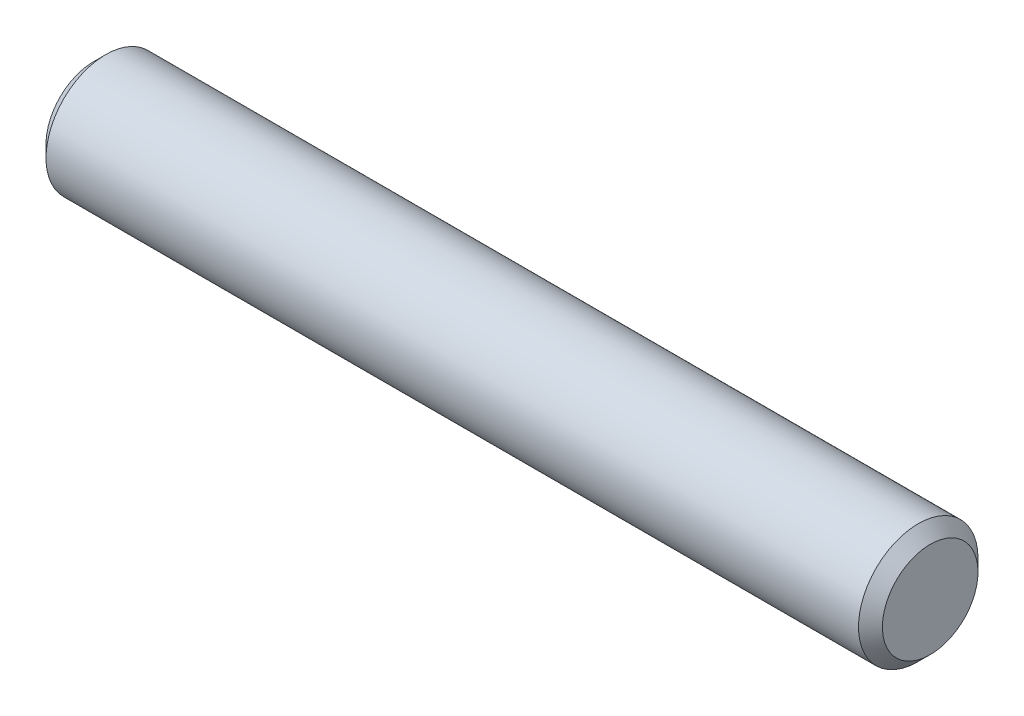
from build123d import *

# Parameters (mm, degrees)
EXTRUDE1_DEPTH      = 22.225
EXTRUDE1_DEPTH_BACK = 22.225
SKETCH2_R           = 3.175
CHAMFER1_SIZE       = 0.635


with BuildPart() as part:
    # Sketch2 → Extrude1 (new, two sides: drawn at the far end of the back side and taken through both)
    with BuildSketch(Plane(origin=(0, 0, 0), x_dir=(0, 0, -1), z_dir=(1, 0, 0)).offset(-EXTRUDE1_DEPTH_BACK)):
        Circle(SKETCH2_R)
    extrude(amount=EXTRUDE1_DEPTH + EXTRUDE1_DEPTH_BACK)

    # Chamfer1
    chamfer1_edges = [part.edges().sort_by_distance(p)[0] for p in [
        (-22.225, 0, 3.175),
        (22.225, 0, 3.175),
    ]]
    chamfer(chamfer1_edges, length=CHAMFER1_SIZE)


solid = part.part
